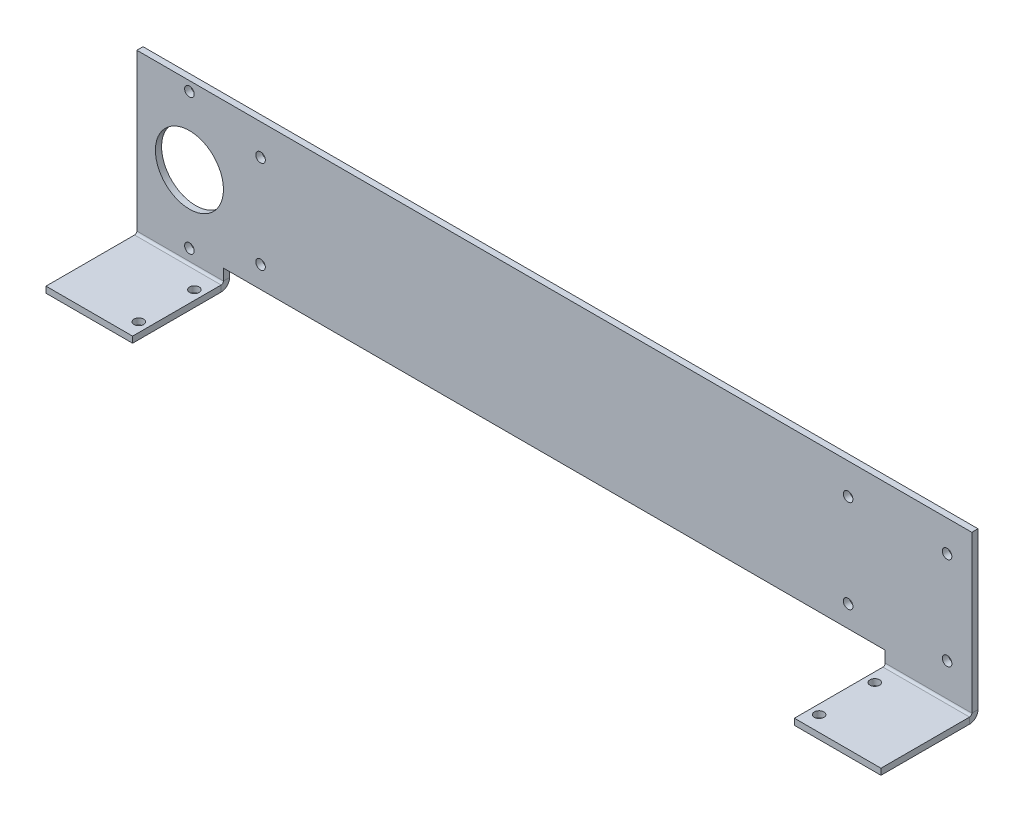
ISO-10303-21;
HEADER;
FILE_DESCRIPTION(('STEP AP214'),'2;1');
FILE_NAME('part.step','',(''),(''),'','','');
FILE_SCHEMA(('AUTOMOTIVE_DESIGN { 1 0 10303 214 1 1 1 1 }'));
ENDSEC;
DATA;
#1=APPLICATION_CONTEXT('core data for automotive mechanical design processes');
#2=APPLICATION_PROTOCOL_DEFINITION('international standard','automotive_design',2000,#1);
#3=PRODUCT_CONTEXT('',#1,'mechanical');
#4=PRODUCT('Part','Part','',(#3));
#5=PRODUCT_RELATED_PRODUCT_CATEGORY('part','',(#4));
#6=PRODUCT_DEFINITION_FORMATION('','',#4);
#7=PRODUCT_DEFINITION_CONTEXT('part definition',#1,'design');
#8=PRODUCT_DEFINITION('design','',#6,#7);
#9=PRODUCT_DEFINITION_SHAPE('','',#8);
#10=(LENGTH_UNIT() NAMED_UNIT(*) SI_UNIT(.MILLI.,.METRE.));
#11=(NAMED_UNIT(*) PLANE_ANGLE_UNIT() SI_UNIT($,.RADIAN.));
#12=(NAMED_UNIT(*) SI_UNIT($,.STERADIAN.) SOLID_ANGLE_UNIT());
#13=UNCERTAINTY_MEASURE_WITH_UNIT(LENGTH_MEASURE(1.E-05),#10,'distance_accuracy_value','');
#14=(GEOMETRIC_REPRESENTATION_CONTEXT(3) GLOBAL_UNCERTAINTY_ASSIGNED_CONTEXT((#13)) GLOBAL_UNIT_ASSIGNED_CONTEXT((#10,
#11,#12)) REPRESENTATION_CONTEXT('',''));
#15=CARTESIAN_POINT('',(0.,0.,0.));
#16=DIRECTION('',(0.,0.,1.));
#17=DIRECTION('',(1.,0.,0.));
#18=AXIS2_PLACEMENT_3D('',#15,#16,#17);
#19=CARTESIAN_POINT('',(0.,0.,0.));
#20=DIRECTION('',(0.,-1.,0.));
#21=DIRECTION('',(0.,0.,-1.));
#22=AXIS2_PLACEMENT_3D('',#19,#20,#21);
#23=PLANE('',#22);
#24=CARTESIAN_POINT('',(-110.,0.,36.));
#25=DIRECTION('',(0.,1.,0.));
#26=DIRECTION('',(0.,0.,-1.));
#27=AXIS2_PLACEMENT_3D('',#24,#25,#26);
#28=CIRCLE('',#27,1.54999999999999);
#29=CARTESIAN_POINT('',(-110.,0.,34.45));
#30=VERTEX_POINT('',#29);
#31=EDGE_CURVE('E346',#30,#30,#28,.T.);
#32=ORIENTED_EDGE('',*,*,#31,.F.);
#33=EDGE_LOOP('',(#32));
#34=FACE_BOUND('',#33,.T.);
#35=CARTESIAN_POINT('',(-110.,0.,18.));
#36=DIRECTION('',(0.,1.,0.));
#37=DIRECTION('',(0.,0.,1.));
#38=AXIS2_PLACEMENT_3D('',#35,#36,#37);
#39=CIRCLE('',#38,1.54999999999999);
#40=CARTESIAN_POINT('',(-110.,0.,19.55));
#41=VERTEX_POINT('',#40);
#42=EDGE_CURVE('E227',#41,#41,#39,.T.);
#43=ORIENTED_EDGE('',*,*,#42,.F.);
#44=EDGE_LOOP('',(#43));
#45=FACE_BOUND('',#44,.T.);
#46=DIRECTION('',(0.,0.,-1.));
#47=VECTOR('',#46,1.);
#48=CARTESIAN_POINT('',(-107.,0.,16.));
#49=LINE('',#48,#47);
#50=CARTESIAN_POINT('',(-107.,0.,41.));
#51=VERTEX_POINT('',#50);
#52=CARTESIAN_POINT('',(-107.,0.,12.363922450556));
#53=VERTEX_POINT('',#52);
#54=EDGE_CURVE('E60',#51,#53,#49,.T.);
#55=ORIENTED_EDGE('',*,*,#54,.T.);
#56=DIRECTION('',(-1.,0.,0.));
#57=VECTOR('',#56,1.);
#58=CARTESIAN_POINT('',(0.,0.,12.363922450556));
#59=LINE('',#58,#57);
#60=CARTESIAN_POINT('',(-135.,0.,12.363922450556));
#61=VERTEX_POINT('',#60);
#62=EDGE_CURVE('E52',#53,#61,#59,.T.);
#63=ORIENTED_EDGE('',*,*,#62,.T.);
#64=DIRECTION('',(0.,0.,1.));
#65=VECTOR('',#64,1.);
#66=CARTESIAN_POINT('',(-135.,0.,41.));
#67=LINE('',#66,#65);
#68=CARTESIAN_POINT('',(-135.,0.,41.));
#69=VERTEX_POINT('',#68);
#70=EDGE_CURVE('E68',#61,#69,#67,.T.);
#71=ORIENTED_EDGE('',*,*,#70,.T.);
#72=DIRECTION('',(1.,0.,0.));
#73=VECTOR('',#72,1.);
#74=CARTESIAN_POINT('',(-135.,0.,41.));
#75=LINE('',#74,#73);
#76=EDGE_CURVE('E358',#69,#51,#75,.T.);
#77=ORIENTED_EDGE('',*,*,#76,.T.);
#78=EDGE_LOOP('',(#55,#63,#71,#77));
#79=FACE_BOUND('',#78,.T.);
#80=ADVANCED_FACE('F43',(#34,#45,#79),#23,.F.);
#81=CARTESIAN_POINT('',(-107.,-2.,16.));
#82=DIRECTION('',(1.,0.,0.));
#83=DIRECTION('',(0.,0.,-1.));
#84=AXIS2_PLACEMENT_3D('',#81,#82,#83);
#85=PLANE('',#84);
#86=DIRECTION('',(0.,-1.,0.));
#87=VECTOR('',#86,1.);
#88=CARTESIAN_POINT('',(-107.,-2.,12.363922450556));
#89=LINE('',#88,#87);
#90=CARTESIAN_POINT('',(-107.,-2.,12.363922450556));
#91=VERTEX_POINT('',#90);
#92=EDGE_CURVE('E12',#53,#91,#89,.T.);
#93=ORIENTED_EDGE('',*,*,#92,.F.);
#94=ORIENTED_EDGE('',*,*,#54,.F.);
#95=DIRECTION('',(0.,1.,0.));
#96=VECTOR('',#95,1.);
#97=CARTESIAN_POINT('',(-107.,-2.,41.));
#98=LINE('',#97,#96);
#99=CARTESIAN_POINT('',(-107.,-2.,41.));
#100=VERTEX_POINT('',#99);
#101=EDGE_CURVE('E360',#100,#51,#98,.T.);
#102=ORIENTED_EDGE('',*,*,#101,.F.);
#103=DIRECTION('',(0.,0.,-1.));
#104=VECTOR('',#103,1.);
#105=CARTESIAN_POINT('',(-107.,-2.,37.394448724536));
#106=LINE('',#105,#104);
#107=EDGE_CURVE('E357',#100,#91,#106,.T.);
#108=ORIENTED_EDGE('',*,*,#107,.T.);
#109=EDGE_LOOP('',(#93,#94,#102,#108));
#110=FACE_BOUND('',#109,.T.);
#111=ADVANCED_FACE('F45',(#110),#85,.T.);
#112=CARTESIAN_POINT('',(-135.,-2.,41.));
#113=DIRECTION('',(0.,0.,1.));
#114=DIRECTION('',(1.,0.,0.));
#115=AXIS2_PLACEMENT_3D('',#112,#113,#114);
#116=PLANE('',#115);
#117=ORIENTED_EDGE('',*,*,#76,.F.);
#118=DIRECTION('',(0.,1.,0.));
#119=VECTOR('',#118,1.);
#120=CARTESIAN_POINT('',(-135.,-2.,41.));
#121=LINE('',#120,#119);
#122=CARTESIAN_POINT('',(-135.,-2.,41.));
#123=VERTEX_POINT('',#122);
#124=EDGE_CURVE('E364',#123,#69,#121,.T.);
#125=ORIENTED_EDGE('',*,*,#124,.F.);
#126=DIRECTION('',(1.,0.,0.));
#127=VECTOR('',#126,1.);
#128=CARTESIAN_POINT('',(-135.,-2.,41.));
#129=LINE('',#128,#127);
#130=EDGE_CURVE('E354',#123,#100,#129,.T.);
#131=ORIENTED_EDGE('',*,*,#130,.T.);
#132=ORIENTED_EDGE('',*,*,#101,.T.);
#133=EDGE_LOOP('',(#117,#125,#131,#132));
#134=FACE_BOUND('',#133,.T.);
#135=ADVANCED_FACE('F381',(#134),#116,.T.);
#136=CARTESIAN_POINT('',(-135.,-2.,41.));
#137=DIRECTION('',(-1.,0.,0.));
#138=DIRECTION('',(0.,0.,1.));
#139=AXIS2_PLACEMENT_3D('',#136,#137,#138);
#140=PLANE('',#139);
#141=DIRECTION('',(0.,1.,0.));
#142=VECTOR('',#141,1.);
#143=CARTESIAN_POINT('',(-135.,-2.,12.363922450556));
#144=LINE('',#143,#142);
#145=CARTESIAN_POINT('',(-135.,-2.,12.363922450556));
#146=VERTEX_POINT('',#145);
#147=EDGE_CURVE('E368',#146,#61,#144,.T.);
#148=ORIENTED_EDGE('',*,*,#147,.F.);
#149=DIRECTION('',(0.,0.,1.));
#150=VECTOR('',#149,1.);
#151=CARTESIAN_POINT('',(-135.,-2.,41.));
#152=LINE('',#151,#150);
#153=EDGE_CURVE('E47',#146,#123,#152,.T.);
#154=ORIENTED_EDGE('',*,*,#153,.T.);
#155=ORIENTED_EDGE('',*,*,#124,.T.);
#156=ORIENTED_EDGE('',*,*,#70,.F.);
#157=EDGE_LOOP('',(#148,#154,#155,#156));
#158=FACE_BOUND('',#157,.T.);
#159=ADVANCED_FACE('F377',(#158),#140,.T.);
#160=CARTESIAN_POINT('',(0.,-2.,0.));
#161=DIRECTION('',(0.,-1.,0.));
#162=DIRECTION('',(0.,0.,-1.));
#163=AXIS2_PLACEMENT_3D('',#160,#161,#162);
#164=PLANE('',#163);
#165=DIRECTION('',(-1.,0.,0.));
#166=VECTOR('',#165,1.);
#167=CARTESIAN_POINT('',(0.,-2.,12.363922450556));
#168=LINE('',#167,#166);
#169=EDGE_CURVE('E363',#91,#146,#168,.T.);
#170=ORIENTED_EDGE('',*,*,#169,.F.);
#171=ORIENTED_EDGE('',*,*,#107,.F.);
#172=ORIENTED_EDGE('',*,*,#130,.F.);
#173=ORIENTED_EDGE('',*,*,#153,.F.);
#174=EDGE_LOOP('',(#170,#171,#172,#173));
#175=FACE_BOUND('',#174,.T.);
#176=CARTESIAN_POINT('',(-110.,-2.,18.));
#177=DIRECTION('',(0.,1.,0.));
#178=DIRECTION('',(0.,0.,1.));
#179=AXIS2_PLACEMENT_3D('',#176,#177,#178);
#180=CIRCLE('',#179,1.54999999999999);
#181=CARTESIAN_POINT('',(-110.,-2.,19.55));
#182=VERTEX_POINT('',#181);
#183=EDGE_CURVE('E343',#182,#182,#180,.T.);
#184=ORIENTED_EDGE('',*,*,#183,.T.);
#185=EDGE_LOOP('',(#184));
#186=FACE_BOUND('',#185,.T.);
#187=CARTESIAN_POINT('',(-110.,-2.,36.));
#188=DIRECTION('',(0.,1.,0.));
#189=DIRECTION('',(0.,0.,-1.));
#190=AXIS2_PLACEMENT_3D('',#187,#188,#189);
#191=CIRCLE('',#190,1.54999999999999);
#192=CARTESIAN_POINT('',(-110.,-2.,34.45));
#193=VERTEX_POINT('',#192);
#194=EDGE_CURVE('E349',#193,#193,#191,.T.);
#195=ORIENTED_EDGE('',*,*,#194,.T.);
#196=EDGE_LOOP('',(#195));
#197=FACE_BOUND('',#196,.T.);
#198=ADVANCED_FACE('F385',(#175,#186,#197),#164,.T.);
#199=CARTESIAN_POINT('',(-110.,-2.,36.));
#200=DIRECTION('',(0.,1.,0.));
#201=DIRECTION('',(0.,0.,1.));
#202=AXIS2_PLACEMENT_3D('',#199,#200,#201);
#203=CYLINDRICAL_SURFACE('',#202,1.54999999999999);
#204=ORIENTED_EDGE('',*,*,#194,.F.);
#205=EDGE_LOOP('',(#204));
#206=FACE_BOUND('',#205,.T.);
#207=ORIENTED_EDGE('',*,*,#31,.T.);
#208=EDGE_LOOP('',(#207));
#209=FACE_BOUND('',#208,.T.);
#210=ADVANCED_FACE('F457',(#206,#209),#203,.F.);
#211=CARTESIAN_POINT('',(-110.,-2.,18.));
#212=DIRECTION('',(0.,1.,0.));
#213=DIRECTION('',(0.,0.,1.));
#214=AXIS2_PLACEMENT_3D('',#211,#212,#213);
#215=CYLINDRICAL_SURFACE('',#214,1.54999999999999);
#216=ORIENTED_EDGE('',*,*,#183,.F.);
#217=EDGE_LOOP('',(#216));
#218=FACE_BOUND('',#217,.T.);
#219=ORIENTED_EDGE('',*,*,#42,.T.);
#220=EDGE_LOOP('',(#219));
#221=FACE_BOUND('',#220,.T.);
#222=ADVANCED_FACE('F462',(#218,#221),#215,.F.);
#223=CARTESIAN_POINT('',(-135.,51.372677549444,9.62732245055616));
#224=DIRECTION('',(0.,1.,0.));
#225=DIRECTION('',(-1.,0.,0.));
#226=AXIS2_PLACEMENT_3D('',#223,#224,#225);
#227=PLANE('',#226);
#228=DIRECTION('',(-1.,0.,0.));
#229=VECTOR('',#228,1.);
#230=CARTESIAN_POINT('',(-135.,51.372677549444,11.6273224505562));
#231=LINE('',#230,#229);
#232=CARTESIAN_POINT('',(135.,51.372677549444,11.6273224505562));
#233=VERTEX_POINT('',#232);
#234=CARTESIAN_POINT('',(-135.,51.372677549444,11.6273224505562));
#235=VERTEX_POINT('',#234);
#236=EDGE_CURVE('E258',#233,#235,#231,.T.);
#237=ORIENTED_EDGE('',*,*,#236,.F.);
#238=DIRECTION('',(0.,0.,1.));
#239=VECTOR('',#238,1.);
#240=CARTESIAN_POINT('',(135.,51.372677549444,9.62732245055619));
#241=LINE('',#240,#239);
#242=CARTESIAN_POINT('',(135.,51.372677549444,9.62732245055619));
#243=VERTEX_POINT('',#242);
#244=EDGE_CURVE('E224',#243,#233,#241,.T.);
#245=ORIENTED_EDGE('',*,*,#244,.F.);
#246=DIRECTION('',(-1.,0.,0.));
#247=VECTOR('',#246,1.);
#248=CARTESIAN_POINT('',(-135.,51.372677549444,9.62732245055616));
#249=LINE('',#248,#247);
#250=CARTESIAN_POINT('',(-135.,51.372677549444,9.62732245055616));
#251=VERTEX_POINT('',#250);
#252=EDGE_CURVE('E337',#243,#251,#249,.T.);
#253=ORIENTED_EDGE('',*,*,#252,.T.);
#254=DIRECTION('',(0.,0.,1.));
#255=VECTOR('',#254,1.);
#256=CARTESIAN_POINT('',(-135.,51.372677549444,9.62732245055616));
#257=LINE('',#256,#255);
#258=EDGE_CURVE('E335',#251,#235,#257,.T.);
#259=ORIENTED_EDGE('',*,*,#258,.T.);
#260=EDGE_LOOP('',(#237,#245,#253,#259));
#261=FACE_BOUND('',#260,.T.);
#262=ADVANCED_FACE('F406',(#261),#227,.T.);
#263=CARTESIAN_POINT('',(-107.,4.37267754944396,9.62732245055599));
#264=DIRECTION('',(0.,-1.,0.));
#265=DIRECTION('',(1.,0.,0.));
#266=AXIS2_PLACEMENT_3D('',#263,#264,#265);
#267=PLANE('',#266);
#268=DIRECTION('',(1.,0.,0.));
#269=VECTOR('',#268,1.);
#270=CARTESIAN_POINT('',(-107.,4.37267754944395,11.627322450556));
#271=LINE('',#270,#269);
#272=CARTESIAN_POINT('',(-107.,4.37267754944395,11.627322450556));
#273=VERTEX_POINT('',#272);
#274=CARTESIAN_POINT('',(107.,4.37267754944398,11.627322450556));
#275=VERTEX_POINT('',#274);
#276=EDGE_CURVE('E250',#273,#275,#271,.T.);
#277=ORIENTED_EDGE('',*,*,#276,.F.);
#278=DIRECTION('',(0.,0.,1.));
#279=VECTOR('',#278,1.);
#280=CARTESIAN_POINT('',(-107.,4.37267754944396,9.62732245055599));
#281=LINE('',#280,#279);
#282=CARTESIAN_POINT('',(-107.,4.37267754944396,9.62732245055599));
#283=VERTEX_POINT('',#282);
#284=EDGE_CURVE('E239',#283,#273,#281,.T.);
#285=ORIENTED_EDGE('',*,*,#284,.F.);
#286=DIRECTION('',(1.,0.,0.));
#287=VECTOR('',#286,1.);
#288=CARTESIAN_POINT('',(-107.,4.37267754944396,9.62732245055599));
#289=LINE('',#288,#287);
#290=CARTESIAN_POINT('',(107.,4.37267754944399,9.62732245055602));
#291=VERTEX_POINT('',#290);
#292=EDGE_CURVE('E332',#283,#291,#289,.T.);
#293=ORIENTED_EDGE('',*,*,#292,.T.);
#294=DIRECTION('',(0.,0.,1.));
#295=VECTOR('',#294,1.);
#296=CARTESIAN_POINT('',(107.,4.37267754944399,9.62732245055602));
#297=LINE('',#296,#295);
#298=EDGE_CURVE('E329',#291,#275,#297,.T.);
#299=ORIENTED_EDGE('',*,*,#298,.T.);
#300=EDGE_LOOP('',(#277,#285,#293,#299));
#301=FACE_BOUND('',#300,.T.);
#302=ADVANCED_FACE('F419',(#301),#267,.T.);
#303=CARTESIAN_POINT('',(-95.,41.372677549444,9.62732245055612));
#304=DIRECTION('',(0.,0.,1.));
#305=DIRECTION('',(0.,-1.,0.));
#306=AXIS2_PLACEMENT_3D('',#303,#304,#305);
#307=CYLINDRICAL_SURFACE('',#306,1.54999999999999);
#308=CARTESIAN_POINT('',(-95.,41.372677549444,9.62732245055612));
#309=DIRECTION('',(0.,0.,1.));
#310=DIRECTION('',(0.,-1.,0.));
#311=AXIS2_PLACEMENT_3D('',#308,#309,#310);
#312=CIRCLE('',#311,1.54999999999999);
#313=CARTESIAN_POINT('',(-95.,39.822677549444,9.62732245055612));
#314=VERTEX_POINT('',#313);
#315=EDGE_CURVE('E275',#314,#314,#312,.T.);
#316=ORIENTED_EDGE('',*,*,#315,.F.);
#317=EDGE_LOOP('',(#316));
#318=FACE_BOUND('',#317,.T.);
#319=CARTESIAN_POINT('',(-95.,41.372677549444,11.6273224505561));
#320=DIRECTION('',(0.,0.,1.));
#321=DIRECTION('',(0.,-1.,0.));
#322=AXIS2_PLACEMENT_3D('',#319,#320,#321);
#323=CIRCLE('',#322,1.54999999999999);
#324=CARTESIAN_POINT('',(-95.,39.822677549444,11.6273224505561));
#325=VERTEX_POINT('',#324);
#326=EDGE_CURVE('E326',#325,#325,#323,.T.);
#327=ORIENTED_EDGE('',*,*,#326,.T.);
#328=EDGE_LOOP('',(#327));
#329=FACE_BOUND('',#328,.T.);
#330=ADVANCED_FACE('F512',(#318,#329),#307,.F.);
#331=CARTESIAN_POINT('',(-95.,11.372677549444,9.62732245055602));
#332=DIRECTION('',(0.,0.,1.));
#333=DIRECTION('',(0.,-1.,0.));
#334=AXIS2_PLACEMENT_3D('',#331,#332,#333);
#335=CYLINDRICAL_SURFACE('',#334,1.54999999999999);
#336=CARTESIAN_POINT('',(-95.,11.372677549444,9.62732245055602));
#337=DIRECTION('',(0.,0.,1.));
#338=DIRECTION('',(0.,-1.,0.));
#339=AXIS2_PLACEMENT_3D('',#336,#337,#338);
#340=CIRCLE('',#339,1.54999999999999);
#341=CARTESIAN_POINT('',(-95.,9.82267754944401,9.62732245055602));
#342=VERTEX_POINT('',#341);
#343=EDGE_CURVE('E278',#342,#342,#340,.T.);
#344=ORIENTED_EDGE('',*,*,#343,.F.);
#345=EDGE_LOOP('',(#344));
#346=FACE_BOUND('',#345,.T.);
#347=CARTESIAN_POINT('',(-95.,11.372677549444,11.627322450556));
#348=DIRECTION('',(0.,0.,1.));
#349=DIRECTION('',(0.,-1.,0.));
#350=AXIS2_PLACEMENT_3D('',#347,#348,#349);
#351=CIRCLE('',#350,1.54999999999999);
#352=CARTESIAN_POINT('',(-95.,9.822677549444,11.627322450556));
#353=VERTEX_POINT('',#352);
#354=EDGE_CURVE('E323',#353,#353,#351,.T.);
#355=ORIENTED_EDGE('',*,*,#354,.T.);
#356=EDGE_LOOP('',(#355));
#357=FACE_BOUND('',#356,.T.);
#358=ADVANCED_FACE('F508',(#346,#357),#335,.F.);
#359=CARTESIAN_POINT('',(-118.,48.322677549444,9.62732245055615));
#360=DIRECTION('',(0.,0.,1.));
#361=DIRECTION('',(0.,-1.,0.));
#362=AXIS2_PLACEMENT_3D('',#359,#360,#361);
#363=CYLINDRICAL_SURFACE('',#362,1.54999999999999);
#364=CARTESIAN_POINT('',(-118.,48.322677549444,9.62732245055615));
#365=DIRECTION('',(0.,0.,1.));
#366=DIRECTION('',(0.,-1.,0.));
#367=AXIS2_PLACEMENT_3D('',#364,#365,#366);
#368=CIRCLE('',#367,1.54999999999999);
#369=CARTESIAN_POINT('',(-118.,46.772677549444,9.62732245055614));
#370=VERTEX_POINT('',#369);
#371=EDGE_CURVE('E281',#370,#370,#368,.T.);
#372=ORIENTED_EDGE('',*,*,#371,.F.);
#373=EDGE_LOOP('',(#372));
#374=FACE_BOUND('',#373,.T.);
#375=CARTESIAN_POINT('',(-118.,48.322677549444,11.6273224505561));
#376=DIRECTION('',(0.,0.,1.));
#377=DIRECTION('',(0.,-1.,0.));
#378=AXIS2_PLACEMENT_3D('',#375,#376,#377);
#379=CIRCLE('',#378,1.54999999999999);
#380=CARTESIAN_POINT('',(-118.,46.772677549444,11.6273224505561));
#381=VERTEX_POINT('',#380);
#382=EDGE_CURVE('E320',#381,#381,#379,.T.);
#383=ORIENTED_EDGE('',*,*,#382,.T.);
#384=EDGE_LOOP('',(#383));
#385=FACE_BOUND('',#384,.T.);
#386=ADVANCED_FACE('F504',(#374,#385),#363,.F.);
#387=CARTESIAN_POINT('',(-118.,4.42267754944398,9.62732245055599));
#388=DIRECTION('',(0.,0.,1.));
#389=DIRECTION('',(0.,-1.,0.));
#390=AXIS2_PLACEMENT_3D('',#387,#388,#389);
#391=CYLINDRICAL_SURFACE('',#390,1.54999999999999);
#392=CARTESIAN_POINT('',(-118.,4.42267754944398,9.62732245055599));
#393=DIRECTION('',(0.,0.,1.));
#394=DIRECTION('',(0.,-1.,0.));
#395=AXIS2_PLACEMENT_3D('',#392,#393,#394);
#396=CIRCLE('',#395,1.54999999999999);
#397=CARTESIAN_POINT('',(-118.,2.87267754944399,9.62732245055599));
#398=VERTEX_POINT('',#397);
#399=EDGE_CURVE('E284',#398,#398,#396,.T.);
#400=ORIENTED_EDGE('',*,*,#399,.F.);
#401=EDGE_LOOP('',(#400));
#402=FACE_BOUND('',#401,.T.);
#403=CARTESIAN_POINT('',(-118.,4.42267754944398,11.627322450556));
#404=DIRECTION('',(0.,0.,1.));
#405=DIRECTION('',(0.,-1.,0.));
#406=AXIS2_PLACEMENT_3D('',#403,#404,#405);
#407=CIRCLE('',#406,1.54999999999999);
#408=CARTESIAN_POINT('',(-118.,2.87267754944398,11.627322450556));
#409=VERTEX_POINT('',#408);
#410=EDGE_CURVE('E317',#409,#409,#407,.T.);
#411=ORIENTED_EDGE('',*,*,#410,.T.);
#412=EDGE_LOOP('',(#411));
#413=FACE_BOUND('',#412,.T.);
#414=ADVANCED_FACE('F500',(#402,#413),#391,.F.);
#415=CARTESIAN_POINT('',(95.,11.372677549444,9.62732245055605));
#416=DIRECTION('',(0.,0.,1.));
#417=DIRECTION('',(0.,-1.,0.));
#418=AXIS2_PLACEMENT_3D('',#415,#416,#417);
#419=CYLINDRICAL_SURFACE('',#418,1.54999999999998);
#420=CARTESIAN_POINT('',(95.,11.372677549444,9.62732245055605));
#421=DIRECTION('',(0.,0.,1.));
#422=DIRECTION('',(0.,1.,0.));
#423=AXIS2_PLACEMENT_3D('',#420,#421,#422);
#424=CIRCLE('',#423,1.54999999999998);
#425=CARTESIAN_POINT('',(95.,12.922677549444,9.62732245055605));
#426=VERTEX_POINT('',#425);
#427=EDGE_CURVE('E287',#426,#426,#424,.T.);
#428=ORIENTED_EDGE('',*,*,#427,.F.);
#429=EDGE_LOOP('',(#428));
#430=FACE_BOUND('',#429,.T.);
#431=CARTESIAN_POINT('',(95.,11.372677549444,11.627322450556));
#432=DIRECTION('',(0.,0.,1.));
#433=DIRECTION('',(0.,1.,0.));
#434=AXIS2_PLACEMENT_3D('',#431,#432,#433);
#435=CIRCLE('',#434,1.54999999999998);
#436=CARTESIAN_POINT('',(95.,12.922677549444,11.6273224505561));
#437=VERTEX_POINT('',#436);
#438=EDGE_CURVE('E314',#437,#437,#435,.T.);
#439=ORIENTED_EDGE('',*,*,#438,.T.);
#440=EDGE_LOOP('',(#439));
#441=FACE_BOUND('',#440,.T.);
#442=ADVANCED_FACE('F496',(#430,#441),#419,.F.);
#443=CARTESIAN_POINT('',(95.,41.372677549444,9.62732245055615));
#444=DIRECTION('',(0.,0.,1.));
#445=DIRECTION('',(0.,-1.,0.));
#446=AXIS2_PLACEMENT_3D('',#443,#444,#445);
#447=CYLINDRICAL_SURFACE('',#446,1.54999999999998);
#448=CARTESIAN_POINT('',(95.,41.372677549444,9.62732245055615));
#449=DIRECTION('',(0.,0.,1.));
#450=DIRECTION('',(0.,1.,0.));
#451=AXIS2_PLACEMENT_3D('',#448,#449,#450);
#452=CIRCLE('',#451,1.54999999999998);
#453=CARTESIAN_POINT('',(95.,42.922677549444,9.62732245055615));
#454=VERTEX_POINT('',#453);
#455=EDGE_CURVE('E290',#454,#454,#452,.T.);
#456=ORIENTED_EDGE('',*,*,#455,.F.);
#457=EDGE_LOOP('',(#456));
#458=FACE_BOUND('',#457,.T.);
#459=CARTESIAN_POINT('',(95.,41.372677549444,11.6273224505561));
#460=DIRECTION('',(0.,0.,1.));
#461=DIRECTION('',(0.,1.,0.));
#462=AXIS2_PLACEMENT_3D('',#459,#460,#461);
#463=CIRCLE('',#462,1.54999999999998);
#464=CARTESIAN_POINT('',(95.,42.922677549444,11.6273224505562));
#465=VERTEX_POINT('',#464);
#466=EDGE_CURVE('E311',#465,#465,#463,.T.);
#467=ORIENTED_EDGE('',*,*,#466,.T.);
#468=EDGE_LOOP('',(#467));
#469=FACE_BOUND('',#468,.T.);
#470=ADVANCED_FACE('F492',(#458,#469),#447,.F.);
#471=CARTESIAN_POINT('',(-118.,26.372677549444,9.62732245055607));
#472=DIRECTION('',(0.,0.,1.));
#473=DIRECTION('',(0.,-1.,0.));
#474=AXIS2_PLACEMENT_3D('',#471,#472,#473);
#475=CYLINDRICAL_SURFACE('',#474,11.);
#476=CARTESIAN_POINT('',(-118.,26.372677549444,9.62732245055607));
#477=DIRECTION('',(0.,0.,1.));
#478=DIRECTION('',(0.,-1.,0.));
#479=AXIS2_PLACEMENT_3D('',#476,#477,#478);
#480=CIRCLE('',#479,11.);
#481=CARTESIAN_POINT('',(-118.,15.372677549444,9.62732245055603));
#482=VERTEX_POINT('',#481);
#483=EDGE_CURVE('E293',#482,#482,#480,.T.);
#484=ORIENTED_EDGE('',*,*,#483,.F.);
#485=EDGE_LOOP('',(#484));
#486=FACE_BOUND('',#485,.T.);
#487=CARTESIAN_POINT('',(-118.,26.372677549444,11.6273224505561));
#488=DIRECTION('',(0.,0.,1.));
#489=DIRECTION('',(0.,-1.,0.));
#490=AXIS2_PLACEMENT_3D('',#487,#488,#489);
#491=CIRCLE('',#490,11.);
#492=CARTESIAN_POINT('',(-118.,15.372677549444,11.627322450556));
#493=VERTEX_POINT('',#492);
#494=EDGE_CURVE('E308',#493,#493,#491,.T.);
#495=ORIENTED_EDGE('',*,*,#494,.T.);
#496=EDGE_LOOP('',(#495));
#497=FACE_BOUND('',#496,.T.);
#498=ADVANCED_FACE('F488',(#486,#497),#475,.F.);
#499=CARTESIAN_POINT('',(127.,41.372677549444,9.62732245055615));
#500=DIRECTION('',(0.,0.,1.));
#501=DIRECTION('',(0.,-1.,0.));
#502=AXIS2_PLACEMENT_3D('',#499,#500,#501);
#503=CYLINDRICAL_SURFACE('',#502,1.54999999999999);
#504=CARTESIAN_POINT('',(127.,41.372677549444,9.62732245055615));
#505=DIRECTION('',(0.,0.,1.));
#506=DIRECTION('',(0.,-1.,0.));
#507=AXIS2_PLACEMENT_3D('',#504,#505,#506);
#508=CIRCLE('',#507,1.54999999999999);
#509=CARTESIAN_POINT('',(127.,39.822677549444,9.62732245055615));
#510=VERTEX_POINT('',#509);
#511=EDGE_CURVE('E296',#510,#510,#508,.T.);
#512=ORIENTED_EDGE('',*,*,#511,.F.);
#513=EDGE_LOOP('',(#512));
#514=FACE_BOUND('',#513,.T.);
#515=CARTESIAN_POINT('',(127.,41.372677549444,11.6273224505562));
#516=DIRECTION('',(0.,0.,1.));
#517=DIRECTION('',(0.,-1.,0.));
#518=AXIS2_PLACEMENT_3D('',#515,#516,#517);
#519=CIRCLE('',#518,1.54999999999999);
#520=CARTESIAN_POINT('',(127.,39.822677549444,11.6273224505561));
#521=VERTEX_POINT('',#520);
#522=EDGE_CURVE('E305',#521,#521,#519,.T.);
#523=ORIENTED_EDGE('',*,*,#522,.T.);
#524=EDGE_LOOP('',(#523));
#525=FACE_BOUND('',#524,.T.);
#526=ADVANCED_FACE('F484',(#514,#525),#503,.F.);
#527=CARTESIAN_POINT('',(127.,11.3726775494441,9.62732245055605));
#528=DIRECTION('',(0.,0.,1.));
#529=DIRECTION('',(0.,-1.,0.));
#530=AXIS2_PLACEMENT_3D('',#527,#528,#529);
#531=CYLINDRICAL_SURFACE('',#530,1.54999999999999);
#532=CARTESIAN_POINT('',(127.,11.3726775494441,9.62732245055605));
#533=DIRECTION('',(0.,0.,1.));
#534=DIRECTION('',(0.,-1.,0.));
#535=AXIS2_PLACEMENT_3D('',#532,#533,#534);
#536=CIRCLE('',#535,1.54999999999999);
#537=CARTESIAN_POINT('',(127.,9.82267754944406,9.62732245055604));
#538=VERTEX_POINT('',#537);
#539=EDGE_CURVE('E299',#538,#538,#536,.T.);
#540=ORIENTED_EDGE('',*,*,#539,.F.);
#541=EDGE_LOOP('',(#540));
#542=FACE_BOUND('',#541,.T.);
#543=CARTESIAN_POINT('',(127.,11.372677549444,11.627322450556));
#544=DIRECTION('',(0.,0.,1.));
#545=DIRECTION('',(0.,-1.,0.));
#546=AXIS2_PLACEMENT_3D('',#543,#544,#545);
#547=CIRCLE('',#546,1.54999999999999);
#548=CARTESIAN_POINT('',(127.,9.82267754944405,11.627322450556));
#549=VERTEX_POINT('',#548);
#550=EDGE_CURVE('E302',#549,#549,#547,.T.);
#551=ORIENTED_EDGE('',*,*,#550,.T.);
#552=EDGE_LOOP('',(#551));
#553=FACE_BOUND('',#552,.T.);
#554=ADVANCED_FACE('F480',(#542,#553),#531,.F.);
#555=CARTESIAN_POINT('',(0.,10.372677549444,9.62732245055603));
#556=DIRECTION('',(0.,0.,-1.));
#557=DIRECTION('',(0.,1.,0.));
#558=AXIS2_PLACEMENT_3D('',#555,#556,#557);
#559=PLANE('',#558);
#560=ORIENTED_EDGE('',*,*,#539,.T.);
#561=EDGE_LOOP('',(#560));
#562=FACE_BOUND('',#561,.T.);
#563=ORIENTED_EDGE('',*,*,#511,.T.);
#564=EDGE_LOOP('',(#563));
#565=FACE_BOUND('',#564,.T.);
#566=ORIENTED_EDGE('',*,*,#483,.T.);
#567=EDGE_LOOP('',(#566));
#568=FACE_BOUND('',#567,.T.);
#569=ORIENTED_EDGE('',*,*,#455,.T.);
#570=EDGE_LOOP('',(#569));
#571=FACE_BOUND('',#570,.T.);
#572=ORIENTED_EDGE('',*,*,#427,.T.);
#573=EDGE_LOOP('',(#572));
#574=FACE_BOUND('',#573,.T.);
#575=ORIENTED_EDGE('',*,*,#399,.T.);
#576=EDGE_LOOP('',(#575));
#577=FACE_BOUND('',#576,.T.);
#578=ORIENTED_EDGE('',*,*,#371,.T.);
#579=EDGE_LOOP('',(#578));
#580=FACE_BOUND('',#579,.T.);
#581=ORIENTED_EDGE('',*,*,#343,.T.);
#582=EDGE_LOOP('',(#581));
#583=FACE_BOUND('',#582,.T.);
#584=ORIENTED_EDGE('',*,*,#315,.T.);
#585=EDGE_LOOP('',(#584));
#586=FACE_BOUND('',#585,.T.);
#587=DIRECTION('',(0.,1.,0.));
#588=VECTOR('',#587,1.);
#589=CARTESIAN_POINT('',(135.,-30.627322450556,9.6273224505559));
#590=LINE('',#589,#588);
#591=CARTESIAN_POINT('',(135.,0.736600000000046,9.62732245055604));
#592=VERTEX_POINT('',#591);
#593=EDGE_CURVE('E228',#592,#243,#590,.T.);
#594=ORIENTED_EDGE('',*,*,#593,.F.);
#595=DIRECTION('',(-1.,0.,0.));
#596=VECTOR('',#595,1.);
#597=CARTESIAN_POINT('',(0.,0.736599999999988,9.627322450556));
#598=LINE('',#597,#596);
#599=CARTESIAN_POINT('',(107.,0.736600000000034,9.62732245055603));
#600=VERTEX_POINT('',#599);
#601=EDGE_CURVE('E272',#592,#600,#598,.T.);
#602=ORIENTED_EDGE('',*,*,#601,.T.);
#603=DIRECTION('',(0.,-1.,0.));
#604=VECTOR('',#603,1.);
#605=CARTESIAN_POINT('',(107.,4.37267754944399,9.62732245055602));
#606=LINE('',#605,#604);
#607=EDGE_CURVE('E236',#291,#600,#606,.T.);
#608=ORIENTED_EDGE('',*,*,#607,.F.);
#609=ORIENTED_EDGE('',*,*,#292,.F.);
#610=DIRECTION('',(0.,1.,0.));
#611=VECTOR('',#610,1.);
#612=CARTESIAN_POINT('',(-107.,-27.0217711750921,9.62732245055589));
#613=LINE('',#612,#611);
#614=CARTESIAN_POINT('',(-107.,0.736599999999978,9.627322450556));
#615=VERTEX_POINT('',#614);
#616=EDGE_CURVE('E242',#615,#283,#613,.T.);
#617=ORIENTED_EDGE('',*,*,#616,.F.);
#618=DIRECTION('',(-1.,0.,0.));
#619=VECTOR('',#618,1.);
#620=CARTESIAN_POINT('',(0.,0.736599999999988,9.627322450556));
#621=LINE('',#620,#619);
#622=CARTESIAN_POINT('',(-135.,0.736599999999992,9.627322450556));
#623=VERTEX_POINT('',#622);
#624=EDGE_CURVE('E269',#615,#623,#621,.T.);
#625=ORIENTED_EDGE('',*,*,#624,.T.);
#626=DIRECTION('',(0.,-1.,0.));
#627=VECTOR('',#626,1.);
#628=CARTESIAN_POINT('',(-135.,-30.627322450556,9.62732245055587));
#629=LINE('',#628,#627);
#630=EDGE_CURVE('E266',#251,#623,#629,.T.);
#631=ORIENTED_EDGE('',*,*,#630,.F.);
#632=ORIENTED_EDGE('',*,*,#252,.F.);
#633=EDGE_LOOP('',(#594,#602,#608,#609,#617,#625,#631,#632));
#634=FACE_BOUND('',#633,.T.);
#635=ADVANCED_FACE('F401',(#562,#565,#568,#571,#574,#577,#580,#583,#586,#634),#559,.T.);
#636=CARTESIAN_POINT('',(-135.,-30.627322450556,9.62732245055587));
#637=DIRECTION('',(-1.,0.,0.));
#638=DIRECTION('',(0.,-1.,0.));
#639=AXIS2_PLACEMENT_3D('',#636,#637,#638);
#640=PLANE('',#639);
#641=ORIENTED_EDGE('',*,*,#630,.T.);
#642=DIRECTION('',(0.,0.,1.));
#643=VECTOR('',#642,1.);
#644=CARTESIAN_POINT('',(-135.,0.736599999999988,9.62732245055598));
#645=LINE('',#644,#643);
#646=CARTESIAN_POINT('',(-135.,0.736599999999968,11.627322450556));
#647=VERTEX_POINT('',#646);
#648=EDGE_CURVE('E263',#623,#647,#645,.T.);
#649=ORIENTED_EDGE('',*,*,#648,.T.);
#650=DIRECTION('',(0.,-1.,0.));
#651=VECTOR('',#650,1.);
#652=CARTESIAN_POINT('',(-135.,-30.627322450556,11.6273224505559));
#653=LINE('',#652,#651);
#654=EDGE_CURVE('E255',#235,#647,#653,.T.);
#655=ORIENTED_EDGE('',*,*,#654,.F.);
#656=ORIENTED_EDGE('',*,*,#258,.F.);
#657=EDGE_LOOP('',(#641,#649,#655,#656));
#658=FACE_BOUND('',#657,.T.);
#659=ADVANCED_FACE('F396',(#658),#640,.T.);
#660=CARTESIAN_POINT('',(0.,10.372677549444,11.627322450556));
#661=DIRECTION('',(0.,0.,-1.));
#662=DIRECTION('',(0.,1.,0.));
#663=AXIS2_PLACEMENT_3D('',#660,#661,#662);
#664=PLANE('',#663);
#665=DIRECTION('',(-1.,0.,0.));
#666=VECTOR('',#665,1.);
#667=CARTESIAN_POINT('',(0.,0.736599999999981,11.627322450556));
#668=LINE('',#667,#666);
#669=CARTESIAN_POINT('',(135.,0.736600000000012,11.627322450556));
#670=VERTEX_POINT('',#669);
#671=CARTESIAN_POINT('',(107.,0.736599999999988,11.627322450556));
#672=VERTEX_POINT('',#671);
#673=EDGE_CURVE('E219',#670,#672,#668,.T.);
#674=ORIENTED_EDGE('',*,*,#673,.F.);
#675=DIRECTION('',(0.,1.,0.));
#676=VECTOR('',#675,1.);
#677=CARTESIAN_POINT('',(135.,-30.627322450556,11.6273224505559));
#678=LINE('',#677,#676);
#679=EDGE_CURVE('E261',#670,#233,#678,.T.);
#680=ORIENTED_EDGE('',*,*,#679,.T.);
#681=ORIENTED_EDGE('',*,*,#236,.T.);
#682=ORIENTED_EDGE('',*,*,#654,.T.);
#683=DIRECTION('',(-1.,0.,0.));
#684=VECTOR('',#683,1.);
#685=CARTESIAN_POINT('',(0.,0.736599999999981,11.627322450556));
#686=LINE('',#685,#684);
#687=CARTESIAN_POINT('',(-107.,0.736599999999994,11.627322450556));
#688=VERTEX_POINT('',#687);
#689=EDGE_CURVE('E340',#688,#647,#686,.T.);
#690=ORIENTED_EDGE('',*,*,#689,.F.);
#691=DIRECTION('',(0.,1.,0.));
#692=VECTOR('',#691,1.);
#693=CARTESIAN_POINT('',(-107.,-5.62732245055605,11.627322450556));
#694=LINE('',#693,#692);
#695=EDGE_CURVE('E253',#688,#273,#694,.T.);
#696=ORIENTED_EDGE('',*,*,#695,.T.);
#697=ORIENTED_EDGE('',*,*,#276,.T.);
#698=DIRECTION('',(0.,-1.,0.));
#699=VECTOR('',#698,1.);
#700=CARTESIAN_POINT('',(107.,-27.627322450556,11.6273224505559));
#701=LINE('',#700,#699);
#702=EDGE_CURVE('E247',#275,#672,#701,.T.);
#703=ORIENTED_EDGE('',*,*,#702,.T.);
#704=EDGE_LOOP('',(#674,#680,#681,#682,#690,#696,#697,#703));
#705=FACE_BOUND('',#704,.T.);
#706=ORIENTED_EDGE('',*,*,#550,.F.);
#707=EDGE_LOOP('',(#706));
#708=FACE_BOUND('',#707,.T.);
#709=ORIENTED_EDGE('',*,*,#522,.F.);
#710=EDGE_LOOP('',(#709));
#711=FACE_BOUND('',#710,.T.);
#712=ORIENTED_EDGE('',*,*,#494,.F.);
#713=EDGE_LOOP('',(#712));
#714=FACE_BOUND('',#713,.T.);
#715=ORIENTED_EDGE('',*,*,#466,.F.);
#716=EDGE_LOOP('',(#715));
#717=FACE_BOUND('',#716,.T.);
#718=ORIENTED_EDGE('',*,*,#438,.F.);
#719=EDGE_LOOP('',(#718));
#720=FACE_BOUND('',#719,.T.);
#721=ORIENTED_EDGE('',*,*,#410,.F.);
#722=EDGE_LOOP('',(#721));
#723=FACE_BOUND('',#722,.T.);
#724=ORIENTED_EDGE('',*,*,#382,.F.);
#725=EDGE_LOOP('',(#724));
#726=FACE_BOUND('',#725,.T.);
#727=ORIENTED_EDGE('',*,*,#354,.F.);
#728=EDGE_LOOP('',(#727));
#729=FACE_BOUND('',#728,.T.);
#730=ORIENTED_EDGE('',*,*,#326,.F.);
#731=EDGE_LOOP('',(#730));
#732=FACE_BOUND('',#731,.T.);
#733=ADVANCED_FACE('F422',(#705,#708,#711,#714,#717,#720,#723,#726,#729,#732),#664,.F.);
#734=CARTESIAN_POINT('',(-107.,-5.62732245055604,9.62732245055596));
#735=DIRECTION('',(1.,0.,0.));
#736=DIRECTION('',(0.,1.,0.));
#737=AXIS2_PLACEMENT_3D('',#734,#735,#736);
#738=PLANE('',#737);
#739=ORIENTED_EDGE('',*,*,#695,.F.);
#740=DIRECTION('',(0.,0.,-1.));
#741=VECTOR('',#740,1.);
#742=CARTESIAN_POINT('',(-107.,0.736599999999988,9.62732245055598));
#743=LINE('',#742,#741);
#744=EDGE_CURVE('E244',#688,#615,#743,.T.);
#745=ORIENTED_EDGE('',*,*,#744,.T.);
#746=ORIENTED_EDGE('',*,*,#616,.T.);
#747=ORIENTED_EDGE('',*,*,#284,.T.);
#748=EDGE_LOOP('',(#739,#745,#746,#747));
#749=FACE_BOUND('',#748,.T.);
#750=ADVANCED_FACE('F427',(#749),#738,.T.);
#751=CARTESIAN_POINT('',(107.,-27.627322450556,9.62732245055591));
#752=DIRECTION('',(-1.,0.,0.));
#753=DIRECTION('',(0.,-1.,0.));
#754=AXIS2_PLACEMENT_3D('',#751,#752,#753);
#755=PLANE('',#754);
#756=ORIENTED_EDGE('',*,*,#607,.T.);
#757=DIRECTION('',(0.,0.,1.));
#758=VECTOR('',#757,1.);
#759=CARTESIAN_POINT('',(107.,0.736599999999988,9.62732245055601));
#760=LINE('',#759,#758);
#761=EDGE_CURVE('E233',#600,#672,#760,.T.);
#762=ORIENTED_EDGE('',*,*,#761,.T.);
#763=ORIENTED_EDGE('',*,*,#702,.F.);
#764=ORIENTED_EDGE('',*,*,#298,.F.);
#765=EDGE_LOOP('',(#756,#762,#763,#764));
#766=FACE_BOUND('',#765,.T.);
#767=ADVANCED_FACE('F416',(#766),#755,.T.);
#768=CARTESIAN_POINT('',(135.,-30.627322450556,9.6273224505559));
#769=DIRECTION('',(1.,0.,0.));
#770=DIRECTION('',(0.,1.,0.));
#771=AXIS2_PLACEMENT_3D('',#768,#769,#770);
#772=PLANE('',#771);
#773=ORIENTED_EDGE('',*,*,#679,.F.);
#774=DIRECTION('',(0.,0.,-1.));
#775=VECTOR('',#774,1.);
#776=CARTESIAN_POINT('',(135.,0.736599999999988,9.62732245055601));
#777=LINE('',#776,#775);
#778=EDGE_CURVE('E230',#670,#592,#777,.T.);
#779=ORIENTED_EDGE('',*,*,#778,.T.);
#780=ORIENTED_EDGE('',*,*,#593,.T.);
#781=ORIENTED_EDGE('',*,*,#244,.T.);
#782=EDGE_LOOP('',(#773,#779,#780,#781));
#783=FACE_BOUND('',#782,.T.);
#784=ADVANCED_FACE('F409',(#783),#772,.T.);
#785=CARTESIAN_POINT('',(135.,0.7366,12.363922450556));
#786=DIRECTION('',(1.,0.,0.));
#787=DIRECTION('',(0.,0.,-1.));
#788=AXIS2_PLACEMENT_3D('',#785,#786,#787);
#789=PLANE('',#788);
#790=ORIENTED_EDGE('',*,*,#778,.F.);
#791=CARTESIAN_POINT('',(135.,0.7366,12.363922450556));
#792=DIRECTION('',(1.,0.,0.));
#793=DIRECTION('',(0.,0.,-1.));
#794=AXIS2_PLACEMENT_3D('',#791,#792,#793);
#795=CIRCLE('',#794,0.7366);
#796=CARTESIAN_POINT('',(135.,0.,12.363922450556));
#797=VERTEX_POINT('',#796);
#798=EDGE_CURVE('E207',#670,#797,#795,.F.);
#799=ORIENTED_EDGE('',*,*,#798,.T.);
#800=DIRECTION('',(0.,-1.,0.));
#801=VECTOR('',#800,1.);
#802=CARTESIAN_POINT('',(135.,-2.,12.363922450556));
#803=LINE('',#802,#801);
#804=CARTESIAN_POINT('',(135.,-2.,12.363922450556));
#805=VERTEX_POINT('',#804);
#806=EDGE_CURVE('E194',#797,#805,#803,.T.);
#807=ORIENTED_EDGE('',*,*,#806,.T.);
#808=CARTESIAN_POINT('',(135.,0.7366,12.363922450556));
#809=DIRECTION('',(-1.,0.,0.));
#810=DIRECTION('',(0.,0.,-1.));
#811=AXIS2_PLACEMENT_3D('',#808,#809,#810);
#812=CIRCLE('',#811,2.7366);
#813=EDGE_CURVE('E212',#592,#805,#812,.T.);
#814=ORIENTED_EDGE('',*,*,#813,.F.);
#815=EDGE_LOOP('',(#790,#799,#807,#814));
#816=FACE_BOUND('',#815,.T.);
#817=ADVANCED_FACE('F469',(#816),#789,.T.);
#818=CARTESIAN_POINT('',(107.,0.7366,12.363922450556));
#819=DIRECTION('',(-1.,0.,0.));
#820=DIRECTION('',(0.,0.,1.));
#821=AXIS2_PLACEMENT_3D('',#818,#819,#820);
#822=PLANE('',#821);
#823=DIRECTION('',(0.,1.,0.));
#824=VECTOR('',#823,1.);
#825=CARTESIAN_POINT('',(107.,-2.,12.363922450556));
#826=LINE('',#825,#824);
#827=CARTESIAN_POINT('',(107.,-2.,12.363922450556));
#828=VERTEX_POINT('',#827);
#829=CARTESIAN_POINT('',(107.,0.,12.363922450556));
#830=VERTEX_POINT('',#829);
#831=EDGE_CURVE('E164',#828,#830,#826,.T.);
#832=ORIENTED_EDGE('',*,*,#831,.T.);
#833=CARTESIAN_POINT('',(107.,0.7366,12.363922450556));
#834=DIRECTION('',(1.,0.,0.));
#835=DIRECTION('',(0.,0.,-1.));
#836=AXIS2_PLACEMENT_3D('',#833,#834,#835);
#837=CIRCLE('',#836,0.7366);
#838=EDGE_CURVE('E216',#830,#672,#837,.T.);
#839=ORIENTED_EDGE('',*,*,#838,.T.);
#840=ORIENTED_EDGE('',*,*,#761,.F.);
#841=CARTESIAN_POINT('',(107.,0.7366,12.363922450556));
#842=DIRECTION('',(1.,0.,0.));
#843=DIRECTION('',(0.,0.,1.));
#844=AXIS2_PLACEMENT_3D('',#841,#842,#843);
#845=CIRCLE('',#844,2.7366);
#846=EDGE_CURVE('E215',#828,#600,#845,.T.);
#847=ORIENTED_EDGE('',*,*,#846,.F.);
#848=EDGE_LOOP('',(#832,#839,#840,#847));
#849=FACE_BOUND('',#848,.T.);
#850=ADVANCED_FACE('F523',(#849),#822,.T.);
#851=CARTESIAN_POINT('',(92.7964339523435,0.7366,12.363922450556));
#852=DIRECTION('',(1.,0.,0.));
#853=DIRECTION('',(0.,0.,-1.));
#854=AXIS2_PLACEMENT_3D('',#851,#852,#853);
#855=CYLINDRICAL_SURFACE('',#854,2.7366);
#856=ORIENTED_EDGE('',*,*,#846,.T.);
#857=ORIENTED_EDGE('',*,*,#601,.F.);
#858=ORIENTED_EDGE('',*,*,#813,.T.);
#859=DIRECTION('',(-1.,0.,0.));
#860=VECTOR('',#859,1.);
#861=CARTESIAN_POINT('',(0.,-2.,12.363922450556));
#862=LINE('',#861,#860);
#863=EDGE_CURVE('E198',#805,#828,#862,.T.);
#864=ORIENTED_EDGE('',*,*,#863,.T.);
#865=EDGE_LOOP('',(#856,#857,#858,#864));
#866=FACE_BOUND('',#865,.T.);
#867=ADVANCED_FACE('F527',(#866),#855,.T.);
#868=CARTESIAN_POINT('',(92.7964339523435,0.7366,12.363922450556));
#869=DIRECTION('',(1.,0.,0.));
#870=DIRECTION('',(0.,0.,-1.));
#871=AXIS2_PLACEMENT_3D('',#868,#869,#870);
#872=CYLINDRICAL_SURFACE('',#871,0.7366);
#873=ORIENTED_EDGE('',*,*,#838,.F.);
#874=DIRECTION('',(-1.,0.,0.));
#875=VECTOR('',#874,1.);
#876=CARTESIAN_POINT('',(0.,0.,12.363922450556));
#877=LINE('',#876,#875);
#878=EDGE_CURVE('E893',#797,#830,#877,.T.);
#879=ORIENTED_EDGE('',*,*,#878,.F.);
#880=ORIENTED_EDGE('',*,*,#798,.F.);
#881=ORIENTED_EDGE('',*,*,#673,.T.);
#882=EDGE_LOOP('',(#873,#879,#880,#881));
#883=FACE_BOUND('',#882,.T.);
#884=ADVANCED_FACE('F529',(#883),#872,.F.);
#885=CARTESIAN_POINT('',(-107.,0.7366,12.363922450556));
#886=DIRECTION('',(1.,0.,0.));
#887=DIRECTION('',(0.,0.,-1.));
#888=AXIS2_PLACEMENT_3D('',#885,#886,#887);
#889=PLANE('',#888);
#890=ORIENTED_EDGE('',*,*,#744,.F.);
#891=CARTESIAN_POINT('',(-107.,0.7366,12.363922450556));
#892=DIRECTION('',(1.,0.,0.));
#893=DIRECTION('',(0.,0.,-1.));
#894=AXIS2_PLACEMENT_3D('',#891,#892,#893);
#895=CIRCLE('',#894,0.7366);
#896=EDGE_CURVE('E175',#688,#53,#895,.F.);
#897=ORIENTED_EDGE('',*,*,#896,.T.);
#898=ORIENTED_EDGE('',*,*,#92,.T.);
#899=CARTESIAN_POINT('',(-107.,0.7366,12.363922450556));
#900=DIRECTION('',(-1.,0.,0.));
#901=DIRECTION('',(0.,0.,-1.));
#902=AXIS2_PLACEMENT_3D('',#899,#900,#901);
#903=CIRCLE('',#902,2.7366);
#904=EDGE_CURVE('E200',#615,#91,#903,.T.);
#905=ORIENTED_EDGE('',*,*,#904,.F.);
#906=EDGE_LOOP('',(#890,#897,#898,#905));
#907=FACE_BOUND('',#906,.T.);
#908=ADVANCED_FACE('F430',(#907),#889,.T.);
#909=CARTESIAN_POINT('',(-135.,0.7366,12.363922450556));
#910=DIRECTION('',(-1.,0.,0.));
#911=DIRECTION('',(0.,0.,1.));
#912=AXIS2_PLACEMENT_3D('',#909,#910,#911);
#913=PLANE('',#912);
#914=ORIENTED_EDGE('',*,*,#147,.T.);
#915=CARTESIAN_POINT('',(-135.,0.7366,12.363922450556));
#916=DIRECTION('',(1.,0.,0.));
#917=DIRECTION('',(0.,0.,-1.));
#918=AXIS2_PLACEMENT_3D('',#915,#916,#917);
#919=CIRCLE('',#918,0.7366);
#920=EDGE_CURVE('E204',#61,#647,#919,.T.);
#921=ORIENTED_EDGE('',*,*,#920,.T.);
#922=ORIENTED_EDGE('',*,*,#648,.F.);
#923=CARTESIAN_POINT('',(-135.,0.7366,12.363922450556));
#924=DIRECTION('',(1.,0.,0.));
#925=DIRECTION('',(0.,0.,1.));
#926=AXIS2_PLACEMENT_3D('',#923,#924,#925);
#927=CIRCLE('',#926,2.7366);
#928=EDGE_CURVE('E203',#146,#623,#927,.T.);
#929=ORIENTED_EDGE('',*,*,#928,.F.);
#930=EDGE_LOOP('',(#914,#921,#922,#929));
#931=FACE_BOUND('',#930,.T.);
#932=ADVANCED_FACE('F392',(#931),#913,.T.);
#933=CARTESIAN_POINT('',(-149.203566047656,0.7366,12.363922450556));
#934=DIRECTION('',(1.,0.,0.));
#935=DIRECTION('',(0.,0.,-1.));
#936=AXIS2_PLACEMENT_3D('',#933,#934,#935);
#937=CYLINDRICAL_SURFACE('',#936,2.7366);
#938=ORIENTED_EDGE('',*,*,#928,.T.);
#939=ORIENTED_EDGE('',*,*,#624,.F.);
#940=ORIENTED_EDGE('',*,*,#904,.T.);
#941=ORIENTED_EDGE('',*,*,#169,.T.);
#942=EDGE_LOOP('',(#938,#939,#940,#941));
#943=FACE_BOUND('',#942,.T.);
#944=ADVANCED_FACE('F389',(#943),#937,.T.);
#945=CARTESIAN_POINT('',(-149.203566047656,0.7366,12.363922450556));
#946=DIRECTION('',(1.,0.,0.));
#947=DIRECTION('',(0.,0.,-1.));
#948=AXIS2_PLACEMENT_3D('',#945,#946,#947);
#949=CYLINDRICAL_SURFACE('',#948,0.7366);
#950=ORIENTED_EDGE('',*,*,#920,.F.);
#951=ORIENTED_EDGE('',*,*,#62,.F.);
#952=ORIENTED_EDGE('',*,*,#896,.F.);
#953=ORIENTED_EDGE('',*,*,#689,.T.);
#954=EDGE_LOOP('',(#950,#951,#952,#953));
#955=FACE_BOUND('',#954,.T.);
#956=ADVANCED_FACE('F432',(#955),#949,.F.);
#957=CARTESIAN_POINT('',(110.,-2.,18.));
#958=DIRECTION('',(0.,1.,0.));
#959=DIRECTION('',(0.,0.,1.));
#960=AXIS2_PLACEMENT_3D('',#957,#958,#959);
#961=CYLINDRICAL_SURFACE('',#960,1.54999999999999);
#962=CARTESIAN_POINT('',(110.,-2.,18.));
#963=DIRECTION('',(0.,1.,0.));
#964=DIRECTION('',(0.,0.,1.));
#965=AXIS2_PLACEMENT_3D('',#962,#963,#964);
#966=CIRCLE('',#965,1.54999999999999);
#967=CARTESIAN_POINT('',(110.,-2.,19.55));
#968=VERTEX_POINT('',#967);
#969=EDGE_CURVE('E904',#968,#968,#966,.T.);
#970=ORIENTED_EDGE('',*,*,#969,.F.);
#971=EDGE_LOOP('',(#970));
#972=FACE_BOUND('',#971,.T.);
#973=CARTESIAN_POINT('',(110.,0.,18.));
#974=DIRECTION('',(0.,1.,0.));
#975=DIRECTION('',(0.,0.,1.));
#976=AXIS2_PLACEMENT_3D('',#973,#974,#975);
#977=CIRCLE('',#976,1.54999999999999);
#978=CARTESIAN_POINT('',(110.,0.,19.55));
#979=VERTEX_POINT('',#978);
#980=EDGE_CURVE('E188',#979,#979,#977,.T.);
#981=ORIENTED_EDGE('',*,*,#980,.T.);
#982=EDGE_LOOP('',(#981));
#983=FACE_BOUND('',#982,.T.);
#984=ADVANCED_FACE('F434',(#972,#983),#961,.F.);
#985=CARTESIAN_POINT('',(110.,-2.,36.));
#986=DIRECTION('',(0.,1.,0.));
#987=DIRECTION('',(0.,0.,1.));
#988=AXIS2_PLACEMENT_3D('',#985,#986,#987);
#989=CYLINDRICAL_SURFACE('',#988,1.54999999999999);
#990=CARTESIAN_POINT('',(110.,-2.,36.));
#991=DIRECTION('',(0.,1.,0.));
#992=DIRECTION('',(0.,0.,1.));
#993=AXIS2_PLACEMENT_3D('',#990,#991,#992);
#994=CIRCLE('',#993,1.54999999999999);
#995=CARTESIAN_POINT('',(110.,-2.,37.55));
#996=VERTEX_POINT('',#995);
#997=EDGE_CURVE('E185',#996,#996,#994,.T.);
#998=ORIENTED_EDGE('',*,*,#997,.F.);
#999=EDGE_LOOP('',(#998));
#1000=FACE_BOUND('',#999,.T.);
#1001=CARTESIAN_POINT('',(110.,0.,36.));
#1002=DIRECTION('',(0.,1.,0.));
#1003=DIRECTION('',(0.,0.,1.));
#1004=AXIS2_PLACEMENT_3D('',#1001,#1002,#1003);
#1005=CIRCLE('',#1004,1.54999999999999);
#1006=CARTESIAN_POINT('',(110.,0.,37.55));
#1007=VERTEX_POINT('',#1006);
#1008=EDGE_CURVE('E183',#1007,#1007,#1005,.T.);
#1009=ORIENTED_EDGE('',*,*,#1008,.T.);
#1010=EDGE_LOOP('',(#1009));
#1011=FACE_BOUND('',#1010,.T.);
#1012=ADVANCED_FACE('F440',(#1000,#1011),#989,.F.);
#1013=CARTESIAN_POINT('',(107.,-2.,41.));
#1014=DIRECTION('',(0.,0.,1.));
#1015=DIRECTION('',(1.,0.,0.));
#1016=AXIS2_PLACEMENT_3D('',#1013,#1014,#1015);
#1017=PLANE('',#1016);
#1018=DIRECTION('',(1.,0.,0.));
#1019=VECTOR('',#1018,1.);
#1020=CARTESIAN_POINT('',(107.,0.,41.));
#1021=LINE('',#1020,#1019);
#1022=CARTESIAN_POINT('',(107.,0.,41.));
#1023=VERTEX_POINT('',#1022);
#1024=CARTESIAN_POINT('',(135.,0.,41.));
#1025=VERTEX_POINT('',#1024);
#1026=EDGE_CURVE('E168',#1023,#1025,#1021,.T.);
#1027=ORIENTED_EDGE('',*,*,#1026,.F.);
#1028=DIRECTION('',(0.,1.,0.));
#1029=VECTOR('',#1028,1.);
#1030=CARTESIAN_POINT('',(107.,-2.,41.));
#1031=LINE('',#1030,#1029);
#1032=CARTESIAN_POINT('',(107.,-2.,41.));
#1033=VERTEX_POINT('',#1032);
#1034=EDGE_CURVE('E161',#1033,#1023,#1031,.T.);
#1035=ORIENTED_EDGE('',*,*,#1034,.F.);
#1036=DIRECTION('',(1.,0.,0.));
#1037=VECTOR('',#1036,1.);
#1038=CARTESIAN_POINT('',(107.,-2.,41.));
#1039=LINE('',#1038,#1037);
#1040=CARTESIAN_POINT('',(135.,-2.,41.));
#1041=VERTEX_POINT('',#1040);
#1042=EDGE_CURVE('E173',#1033,#1041,#1039,.T.);
#1043=ORIENTED_EDGE('',*,*,#1042,.T.);
#1044=DIRECTION('',(0.,1.,0.));
#1045=VECTOR('',#1044,1.);
#1046=CARTESIAN_POINT('',(135.,-2.,41.));
#1047=LINE('',#1046,#1045);
#1048=EDGE_CURVE('E182',#1041,#1025,#1047,.T.);
#1049=ORIENTED_EDGE('',*,*,#1048,.T.);
#1050=EDGE_LOOP('',(#1027,#1035,#1043,#1049));
#1051=FACE_BOUND('',#1050,.T.);
#1052=ADVANCED_FACE('F172',(#1051),#1017,.T.);
#1053=CARTESIAN_POINT('',(0.,-2.,0.));
#1054=DIRECTION('',(0.,-1.,0.));
#1055=DIRECTION('',(0.,0.,-1.));
#1056=AXIS2_PLACEMENT_3D('',#1053,#1054,#1055);
#1057=PLANE('',#1056);
#1058=ORIENTED_EDGE('',*,*,#863,.F.);
#1059=DIRECTION('',(0.,0.,-1.));
#1060=VECTOR('',#1059,1.);
#1061=CARTESIAN_POINT('',(135.,-2.,41.));
#1062=LINE('',#1061,#1060);
#1063=EDGE_CURVE('E181',#1041,#805,#1062,.T.);
#1064=ORIENTED_EDGE('',*,*,#1063,.F.);
#1065=ORIENTED_EDGE('',*,*,#1042,.F.);
#1066=DIRECTION('',(0.,0.,1.));
#1067=VECTOR('',#1066,1.);
#1068=CARTESIAN_POINT('',(107.,-2.,6.00000000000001));
#1069=LINE('',#1068,#1067);
#1070=EDGE_CURVE('E158',#828,#1033,#1069,.T.);
#1071=ORIENTED_EDGE('',*,*,#1070,.F.);
#1072=EDGE_LOOP('',(#1058,#1064,#1065,#1071));
#1073=FACE_BOUND('',#1072,.T.);
#1074=ORIENTED_EDGE('',*,*,#997,.T.);
#1075=EDGE_LOOP('',(#1074));
#1076=FACE_BOUND('',#1075,.T.);
#1077=ORIENTED_EDGE('',*,*,#969,.T.);
#1078=EDGE_LOOP('',(#1077));
#1079=FACE_BOUND('',#1078,.T.);
#1080=ADVANCED_FACE('F178',(#1073,#1076,#1079),#1057,.T.);
#1081=CARTESIAN_POINT('',(135.,-2.,41.));
#1082=DIRECTION('',(1.,0.,0.));
#1083=DIRECTION('',(0.,0.,-1.));
#1084=AXIS2_PLACEMENT_3D('',#1081,#1082,#1083);
#1085=PLANE('',#1084);
#1086=ORIENTED_EDGE('',*,*,#806,.F.);
#1087=DIRECTION('',(0.,0.,-1.));
#1088=VECTOR('',#1087,1.);
#1089=CARTESIAN_POINT('',(135.,0.,41.));
#1090=LINE('',#1089,#1088);
#1091=EDGE_CURVE('E890',#1025,#797,#1090,.T.);
#1092=ORIENTED_EDGE('',*,*,#1091,.F.);
#1093=ORIENTED_EDGE('',*,*,#1048,.F.);
#1094=ORIENTED_EDGE('',*,*,#1063,.T.);
#1095=EDGE_LOOP('',(#1086,#1092,#1093,#1094));
#1096=FACE_BOUND('',#1095,.T.);
#1097=ADVANCED_FACE('F588',(#1096),#1085,.T.);
#1098=CARTESIAN_POINT('',(0.,0.,0.));
#1099=DIRECTION('',(0.,-1.,0.));
#1100=DIRECTION('',(0.,0.,-1.));
#1101=AXIS2_PLACEMENT_3D('',#1098,#1099,#1100);
#1102=PLANE('',#1101);
#1103=ORIENTED_EDGE('',*,*,#1008,.F.);
#1104=EDGE_LOOP('',(#1103));
#1105=FACE_BOUND('',#1104,.T.);
#1106=ORIENTED_EDGE('',*,*,#980,.F.);
#1107=EDGE_LOOP('',(#1106));
#1108=FACE_BOUND('',#1107,.T.);
#1109=ORIENTED_EDGE('',*,*,#1091,.T.);
#1110=ORIENTED_EDGE('',*,*,#878,.T.);
#1111=DIRECTION('',(0.,0.,1.));
#1112=VECTOR('',#1111,1.);
#1113=CARTESIAN_POINT('',(107.,0.,38.));
#1114=LINE('',#1113,#1112);
#1115=EDGE_CURVE('E897',#830,#1023,#1114,.T.);
#1116=ORIENTED_EDGE('',*,*,#1115,.T.);
#1117=ORIENTED_EDGE('',*,*,#1026,.T.);
#1118=EDGE_LOOP('',(#1109,#1110,#1116,#1117));
#1119=FACE_BOUND('',#1118,.T.);
#1120=ADVANCED_FACE('F597',(#1105,#1108,#1119),#1102,.F.);
#1121=CARTESIAN_POINT('',(107.,-2.,38.));
#1122=DIRECTION('',(-1.,0.,0.));
#1123=DIRECTION('',(0.,0.,1.));
#1124=AXIS2_PLACEMENT_3D('',#1121,#1122,#1123);
#1125=PLANE('',#1124);
#1126=ORIENTED_EDGE('',*,*,#831,.F.);
#1127=ORIENTED_EDGE('',*,*,#1070,.T.);
#1128=ORIENTED_EDGE('',*,*,#1034,.T.);
#1129=ORIENTED_EDGE('',*,*,#1115,.F.);
#1130=EDGE_LOOP('',(#1126,#1127,#1128,#1129));
#1131=FACE_BOUND('',#1130,.T.);
#1132=ADVANCED_FACE('F160',(#1131),#1125,.T.);
#1133=CLOSED_SHELL('',(#80,#111,#135,#159,#198,#210,#222,#262,#302,#330,#358,#386,#414,#442,
#470,#498,#526,#554,#635,#659,#733,#750,#767,#784,#817,#850,#867,#884,#908,#932,#944,#956,#984,
#1012,#1052,#1080,#1097,#1120,#1132));
#1134=MANIFOLD_SOLID_BREP('B2',#1133);
#1135=ADVANCED_BREP_SHAPE_REPRESENTATION('',(#18,#1134),#14);
#1136=SHAPE_DEFINITION_REPRESENTATION(#9,#1135);
ENDSEC;
END-ISO-10303-21;
